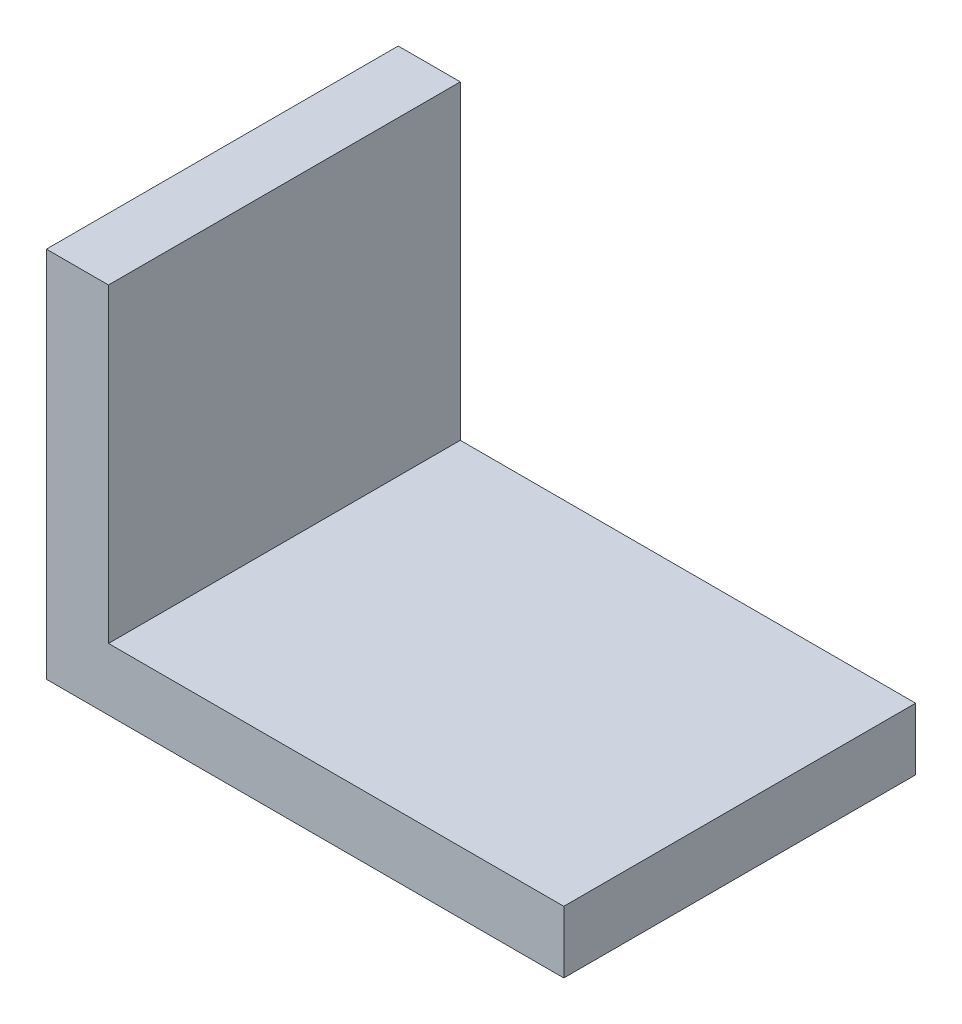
from build123d import *

# Parameters (mm, degrees)
EXTRUDE1_DEPTH = 42.5


with BuildPart() as part:
    # Sketch1 → Extrude1 (new, symmetric)
    with BuildSketch(Plane.XY):
        Polygon((0, 0), (0, 90), (15, 90), (15, 15), (125, 15), (125, 0), align=None)
    extrude(amount=EXTRUDE1_DEPTH, both=True)


solid = part.part
